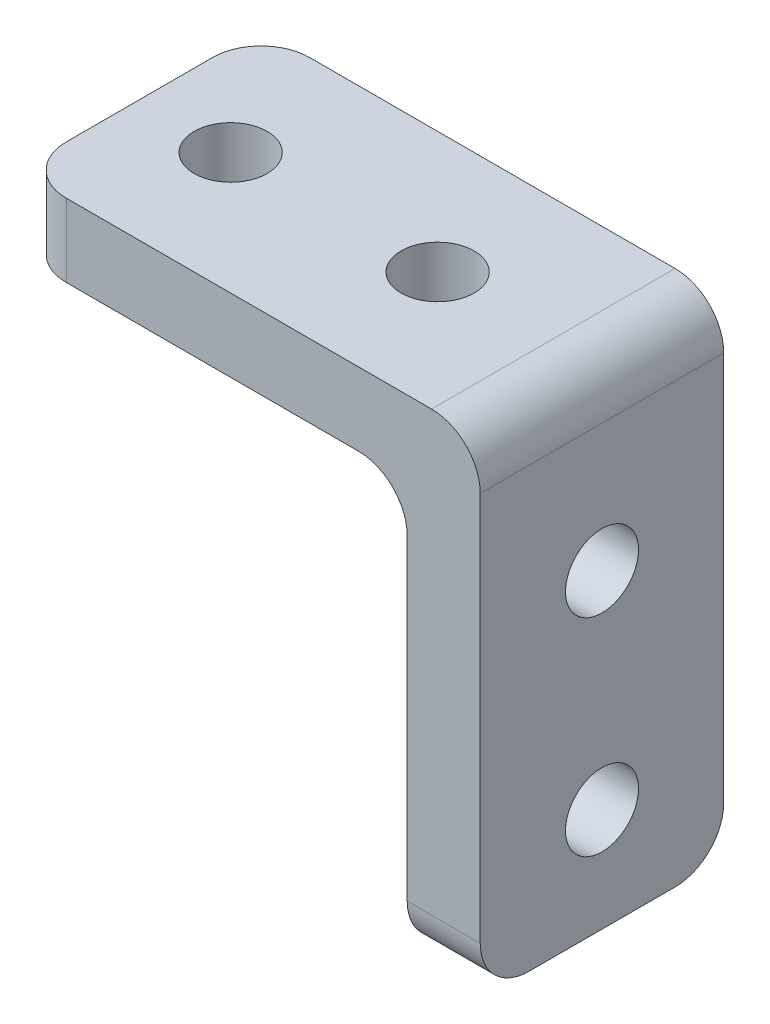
from build123d import *

# Parameters (mm, degrees)
SKETCH1_W           = 16
SKETCH1_H           = 10
SKETCH1_R           = 1.5
BOSS_EXTRUDE1_DEPTH = 3
SKETCH2_W           = 3
SKETCH2_H           = 10
BOSS_EXTRUDE2_DEPTH = 20
SKETCH3_R           = 1.5
CUT_EXTRUDE1_DEPTH  = 20
FILLET1_R           = 2


with BuildPart() as part:
    # Sketch1 → Boss-Extrude1 (new body)
    with BuildSketch(Plane(origin=(0, 0, 0), x_dir=(1, 0, 0), z_dir=(0, 1, 0))):
        Rectangle(SKETCH1_W, SKETCH1_H)
        with Locations(Location((4.25, 0, 0), (0, 0, 270))):
            Circle(SKETCH1_R, mode=Mode.SUBTRACT)
        with Locations(Location((-4.25, 0, 0), (0, 0, 90))):
            Circle(SKETCH1_R, mode=Mode.SUBTRACT)
    extrude(amount=BOSS_EXTRUDE1_DEPTH)

    # Sketch2 → Boss-Extrude2 (add)
    with BuildSketch(Plane(origin=(0, 3, 0), x_dir=(1, 0, 0), z_dir=(0, 1, 0))):
        with Locations((9.5, 0)):
            Rectangle(SKETCH2_W, SKETCH2_H)
    extrude(amount=-BOSS_EXTRUDE2_DEPTH)

    # Sketch3 → Cut-Extrude1 (cut)
    with BuildSketch(Plane.ZY.offset(-8)):
        with Locations((0, -12.75)):
            Circle(SKETCH3_R)
        with Locations(Location((0, -4.25, 0), (0, 0, 180))):
            Circle(SKETCH3_R)
    extrude(amount=-CUT_EXTRUDE1_DEPTH, mode=Mode.SUBTRACT)

    # Fillet1
    fillet1_edges = [part.edges().sort_by_distance(p)[0] for p in [
        (9.5, -17, -5),
        (9.5, -17, 5),
        (11, 3, 0),
        (8, 0, 0),
        (-8, 1.5, -5),
        (-8, 1.5, 5),
    ]]
    fillet(fillet1_edges, radius=FILLET1_R)


solid = part.part
